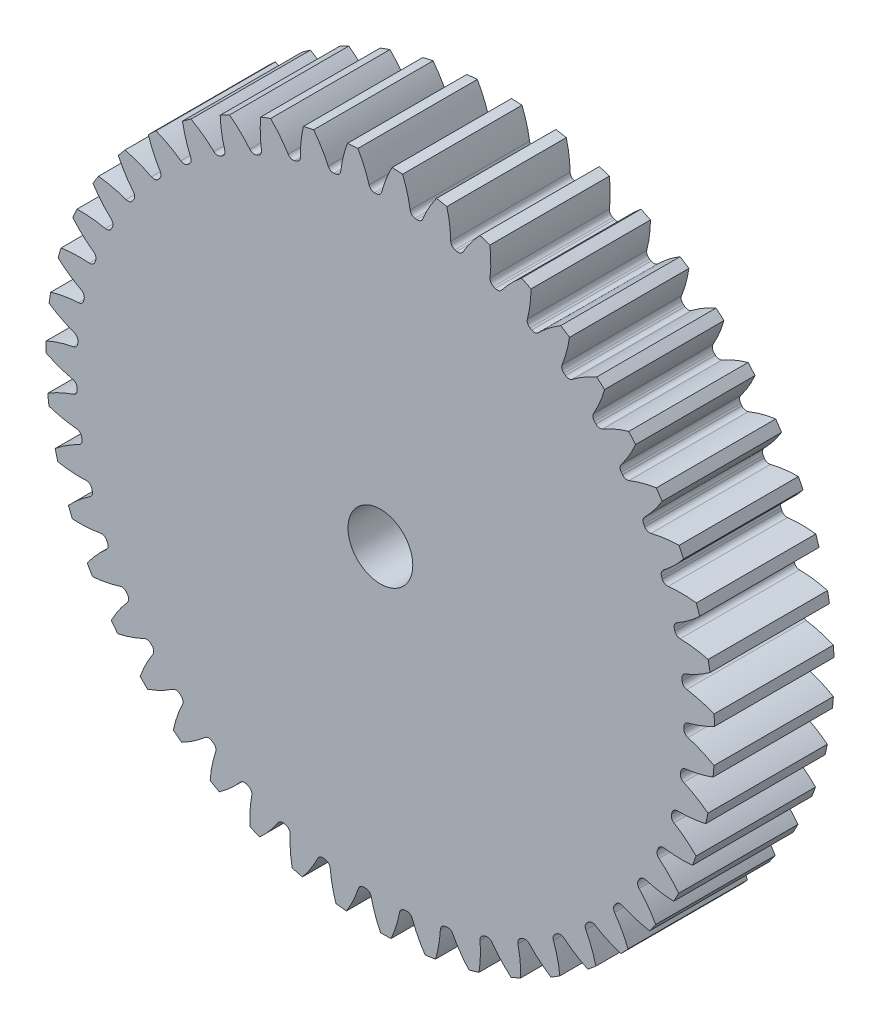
from build123d import *

# Parameters (mm, degrees)
SKETCH3_R         = 248.92
GEARBODY_DEPTH    = 88.9
TOOTHCUT_DEPTH    = 364.077874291
CIRPATTERN1_COUNT = 47
BOREDIA_R         = 24.13
BORE_DEPTH        = 12700


with BuildPart() as part:
    # Sketch3 → gearBody (new body)
    with BuildSketch(Plane.XY):
        Circle(SKETCH3_R)
    extrude(amount=GEARBODY_DEPTH)

    # Sketch2 → toothCut (cut, through all)
    with BuildSketch(Plane.XY):
        with BuildLine():
            ThreePointArc((226.012728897, -4.622767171), (226.02639992, -3.897452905), (226.037743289, -3.172098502))
            ThreePointArc((226.037743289, -3.172098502), (226.922722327, -0.673084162), (229.143433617, 0.774915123))
            ThreePointArc((229.143433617, 0.774915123), (239.266155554, 4.040602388), (248.92, 8.505745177))
            ThreePointArc((248.92, 8.505745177), (249.028261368, -4.294082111), (248.478771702, -17.082567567))
            ThreePointArc((248.478771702, -17.082567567), (238.984608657, -12.287248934), (228.980493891, -8.674507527))
            ThreePointArc((228.980493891, -8.674507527), (226.811024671, -7.150806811), (226.012728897, -4.622767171))
        make_face()
    toothcut = extrude(amount=TOOTHCUT_DEPTH, mode=Mode.SUBTRACT)

    # CirPattern1: toothCut ×47 about axis
    cirpattern1_axis = Axis((0, 0, 0), (0, 0, 1))
    for i in range(1, CIRPATTERN1_COUNT):
        add(toothcut.rotate(cirpattern1_axis, i * 360 / CIRPATTERN1_COUNT), mode=Mode.SUBTRACT)

    # boreDia → bore (cut, symmetric)
    with BuildSketch(Plane.XY):
        Circle(BOREDIA_R)
    extrude(amount=BORE_DEPTH, both=True, mode=Mode.SUBTRACT)


solid = part.part
